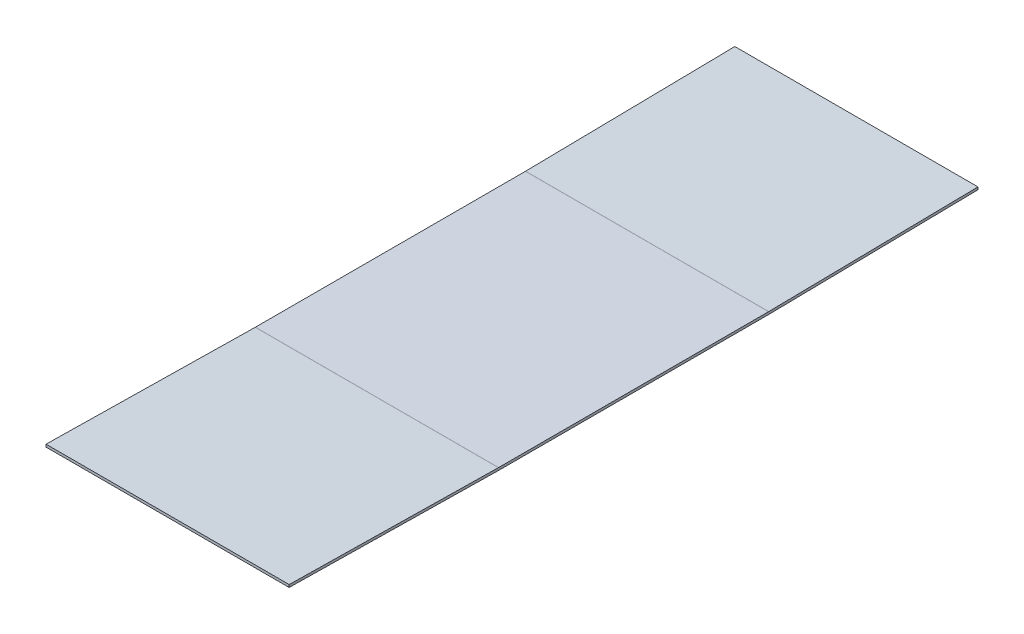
ISO-10303-21;
HEADER;
FILE_DESCRIPTION(('STEP AP214'),'2;1');
FILE_NAME('part.step','',(''),(''),'','','');
FILE_SCHEMA(('AUTOMOTIVE_DESIGN { 1 0 10303 214 1 1 1 1 }'));
ENDSEC;
DATA;
#1=APPLICATION_CONTEXT('core data for automotive mechanical design processes');
#2=APPLICATION_PROTOCOL_DEFINITION('international standard','automotive_design',2000,#1);
#3=PRODUCT_CONTEXT('',#1,'mechanical');
#4=PRODUCT('Part','Part','',(#3));
#5=PRODUCT_RELATED_PRODUCT_CATEGORY('part','',(#4));
#6=PRODUCT_DEFINITION_FORMATION('','',#4);
#7=PRODUCT_DEFINITION_CONTEXT('part definition',#1,'design');
#8=PRODUCT_DEFINITION('design','',#6,#7);
#9=PRODUCT_DEFINITION_SHAPE('','',#8);
#10=(LENGTH_UNIT() NAMED_UNIT(*) SI_UNIT(.MILLI.,.METRE.));
#11=(NAMED_UNIT(*) PLANE_ANGLE_UNIT() SI_UNIT($,.RADIAN.));
#12=(NAMED_UNIT(*) SI_UNIT($,.STERADIAN.) SOLID_ANGLE_UNIT());
#13=UNCERTAINTY_MEASURE_WITH_UNIT(LENGTH_MEASURE(1.E-05),#10,'distance_accuracy_value','');
#14=(GEOMETRIC_REPRESENTATION_CONTEXT(3) GLOBAL_UNCERTAINTY_ASSIGNED_CONTEXT((#13)) GLOBAL_UNIT_ASSIGNED_CONTEXT((#10,
#11,#12)) REPRESENTATION_CONTEXT('',''));
#15=CARTESIAN_POINT('',(0.,0.,0.));
#16=DIRECTION('',(0.,0.,1.));
#17=DIRECTION('',(1.,0.,0.));
#18=AXIS2_PLACEMENT_3D('',#15,#16,#17);
#19=CARTESIAN_POINT('',(-457.2,0.000393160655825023,254.000001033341));
#20=DIRECTION('',(0.,-0.99986986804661,0.0161321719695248));
#21=DIRECTION('',(0.,-0.0161321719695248,-0.99986986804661));
#22=AXIS2_PLACEMENT_3D('',#19,#20,#21);
#23=PLANE('',#22);
#24=DIRECTION('',(0.,-0.0161321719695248,-0.99986986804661));
#25=VECTOR('',#24,1.);
#26=CARTESIAN_POINT('',(-457.2,0.000393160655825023,254.000001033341));
#27=LINE('',#26,#25);
#28=CARTESIAN_POINT('',(-457.2,6.35162926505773,647.648768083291));
#29=VERTEX_POINT('',#28);
#30=CARTESIAN_POINT('',(-457.2,0.00369851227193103,254.204866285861));
#31=VERTEX_POINT('',#30);
#32=EDGE_CURVE('E149',#29,#31,#27,.T.);
#33=ORIENTED_EDGE('',*,*,#32,.T.);
#34=DIRECTION('',(1.,0.,0.));
#35=VECTOR('',#34,1.);
#36=CARTESIAN_POINT('',(-457.2,0.00369851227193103,254.204866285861));
#37=LINE('',#36,#35);
#38=CARTESIAN_POINT('',(0.,0.00369851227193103,254.204866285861));
#39=VERTEX_POINT('',#38);
#40=EDGE_CURVE('E192',#31,#39,#37,.T.);
#41=ORIENTED_EDGE('',*,*,#40,.T.);
#42=DIRECTION('',(0.,-0.0161321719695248,-0.99986986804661));
#43=VECTOR('',#42,1.);
#44=CARTESIAN_POINT('',(0.,0.000393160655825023,254.000001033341));
#45=LINE('',#44,#43);
#46=CARTESIAN_POINT('',(0.,6.35162926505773,647.648768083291));
#47=VERTEX_POINT('',#46);
#48=EDGE_CURVE('E213',#47,#39,#45,.T.);
#49=ORIENTED_EDGE('',*,*,#48,.F.);
#50=DIRECTION('',(1.,0.,0.));
#51=VECTOR('',#50,1.);
#52=CARTESIAN_POINT('',(-457.2,6.35162926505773,647.648768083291));
#53=LINE('',#52,#51);
#54=EDGE_CURVE('E168',#29,#47,#53,.T.);
#55=ORIENTED_EDGE('',*,*,#54,.F.);
#56=EDGE_LOOP('',(#33,#41,#49,#55));
#57=FACE_BOUND('',#56,.T.);
#58=ADVANCED_FACE('F32',(#57),#23,.T.);
#59=CARTESIAN_POINT('',(-457.2,11.1001931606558,647.572153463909));
#60=DIRECTION('',(0.,0.0161321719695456,0.99986986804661));
#61=DIRECTION('',(0.,-0.99986986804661,0.0161321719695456));
#62=AXIS2_PLACEMENT_3D('',#59,#60,#61);
#63=PLANE('',#62);
#64=DIRECTION('',(0.,-0.99986986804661,0.0161321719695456));
#65=VECTOR('',#64,1.);
#66=CARTESIAN_POINT('',(0.,11.1001931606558,647.572153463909));
#67=LINE('',#66,#65);
#68=CARTESIAN_POINT('',(0.,11.1001931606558,647.572153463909));
#69=VERTEX_POINT('',#68);
#70=EDGE_CURVE('E146',#69,#47,#67,.T.);
#71=ORIENTED_EDGE('',*,*,#70,.F.);
#72=DIRECTION('',(1.,0.,0.));
#73=VECTOR('',#72,1.);
#74=CARTESIAN_POINT('',(-457.2,11.1001931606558,647.572153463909));
#75=LINE('',#74,#73);
#76=CARTESIAN_POINT('',(-457.2,11.1001931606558,647.572153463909));
#77=VERTEX_POINT('',#76);
#78=EDGE_CURVE('E171',#77,#69,#75,.T.);
#79=ORIENTED_EDGE('',*,*,#78,.F.);
#80=DIRECTION('',(0.,-0.99986986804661,0.0161321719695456));
#81=VECTOR('',#80,1.);
#82=CARTESIAN_POINT('',(-457.2,11.1001931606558,647.572153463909));
#83=LINE('',#82,#81);
#84=EDGE_CURVE('E132',#77,#29,#83,.T.);
#85=ORIENTED_EDGE('',*,*,#84,.T.);
#86=ORIENTED_EDGE('',*,*,#54,.T.);
#87=EDGE_LOOP('',(#71,#79,#85,#86));
#88=FACE_BOUND('',#87,.T.);
#89=ADVANCED_FACE('F234',(#88),#63,.T.);
#90=CARTESIAN_POINT('',(-457.2,4.75019316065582,254.));
#91=DIRECTION('',(0.,0.99986986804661,-0.0161321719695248));
#92=DIRECTION('',(0.,0.0161321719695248,0.99986986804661));
#93=AXIS2_PLACEMENT_3D('',#90,#91,#92);
#94=PLANE('',#93);
#95=DIRECTION('',(0.,0.0161321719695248,0.99986986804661));
#96=VECTOR('',#95,1.);
#97=CARTESIAN_POINT('',(0.,4.75019316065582,254.));
#98=LINE('',#97,#96);
#99=CARTESIAN_POINT('',(0.,4.75349851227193,254.204865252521));
#100=VERTEX_POINT('',#99);
#101=EDGE_CURVE('E144',#100,#69,#98,.T.);
#102=ORIENTED_EDGE('',*,*,#101,.F.);
#103=DIRECTION('',(1.,0.,0.));
#104=VECTOR('',#103,1.);
#105=CARTESIAN_POINT('',(-457.2,4.75349851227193,254.204865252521));
#106=LINE('',#105,#104);
#107=CARTESIAN_POINT('',(-457.2,4.75349851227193,254.204865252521));
#108=VERTEX_POINT('',#107);
#109=EDGE_CURVE('E179',#100,#108,#106,.F.);
#110=ORIENTED_EDGE('',*,*,#109,.T.);
#111=DIRECTION('',(0.,0.0161321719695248,0.99986986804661));
#112=VECTOR('',#111,1.);
#113=CARTESIAN_POINT('',(-457.2,4.75019316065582,254.));
#114=LINE('',#113,#112);
#115=EDGE_CURVE('E164',#108,#77,#114,.T.);
#116=ORIENTED_EDGE('',*,*,#115,.T.);
#117=ORIENTED_EDGE('',*,*,#78,.T.);
#118=EDGE_LOOP('',(#102,#110,#116,#117));
#119=FACE_BOUND('',#118,.T.);
#120=ADVANCED_FACE('F238',(#119),#94,.T.);
#121=CARTESIAN_POINT('',(-457.2,4.75019316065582,254.));
#122=DIRECTION('',(0.,1.,0.));
#123=DIRECTION('',(0.,0.,1.));
#124=AXIS2_PLACEMENT_3D('',#121,#122,#123);
#125=PLANE('',#124);
#126=DIRECTION('',(0.,0.,1.));
#127=VECTOR('',#126,1.);
#128=CARTESIAN_POINT('',(-457.2,4.75019316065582,254.));
#129=LINE('',#128,#127);
#130=CARTESIAN_POINT('',(-457.2,4.75019316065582,-253.795108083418));
#131=VERTEX_POINT('',#130);
#132=CARTESIAN_POINT('',(-457.2,4.75019316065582,253.795108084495));
#133=VERTEX_POINT('',#132);
#134=EDGE_CURVE('E161',#131,#133,#129,.T.);
#135=ORIENTED_EDGE('',*,*,#134,.T.);
#136=DIRECTION('',(1.,0.,0.));
#137=VECTOR('',#136,1.);
#138=CARTESIAN_POINT('',(0.,4.75019316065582,253.795108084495));
#139=LINE('',#138,#137);
#140=CARTESIAN_POINT('',(0.,4.75019316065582,253.795108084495));
#141=VERTEX_POINT('',#140);
#142=EDGE_CURVE('E176',#133,#141,#139,.T.);
#143=ORIENTED_EDGE('',*,*,#142,.T.);
#144=DIRECTION('',(0.,0.,1.));
#145=VECTOR('',#144,1.);
#146=CARTESIAN_POINT('',(0.,4.75019316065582,254.));
#147=LINE('',#146,#145);
#148=CARTESIAN_POINT('',(0.,4.75019316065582,-253.795108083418));
#149=VERTEX_POINT('',#148);
#150=EDGE_CURVE('E138',#149,#141,#147,.T.);
#151=ORIENTED_EDGE('',*,*,#150,.F.);
#152=DIRECTION('',(1.,0.,0.));
#153=VECTOR('',#152,1.);
#154=CARTESIAN_POINT('',(-457.2,4.75019316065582,-253.795108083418));
#155=LINE('',#154,#153);
#156=EDGE_CURVE('E170',#149,#131,#155,.F.);
#157=ORIENTED_EDGE('',*,*,#156,.T.);
#158=EDGE_LOOP('',(#135,#143,#151,#157));
#159=FACE_BOUND('',#158,.T.);
#160=ADVANCED_FACE('F244',(#159),#125,.T.);
#161=CARTESIAN_POINT('',(-457.2,4.75019316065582,-254.));
#162=DIRECTION('',(0.,0.999869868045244,0.0161321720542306));
#163=DIRECTION('',(0.,-0.0161321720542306,0.999869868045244));
#164=AXIS2_PLACEMENT_3D('',#161,#162,#163);
#165=PLANE('',#164);
#166=DIRECTION('',(0.,-0.0161321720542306,0.999869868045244));
#167=VECTOR('',#166,1.);
#168=CARTESIAN_POINT('',(-457.2,4.75019316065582,-254.));
#169=LINE('',#168,#167);
#170=CARTESIAN_POINT('',(-457.2,11.1001931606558,-647.572151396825));
#171=VERTEX_POINT('',#170);
#172=CARTESIAN_POINT('',(-457.2,4.75349851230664,-254.204865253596));
#173=VERTEX_POINT('',#172);
#174=EDGE_CURVE('E158',#171,#173,#169,.T.);
#175=ORIENTED_EDGE('',*,*,#174,.T.);
#176=DIRECTION('',(1.,0.,0.));
#177=VECTOR('',#176,1.);
#178=CARTESIAN_POINT('',(0.,4.75349851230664,-254.204865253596));
#179=LINE('',#178,#177);
#180=CARTESIAN_POINT('',(0.,4.75349851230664,-254.204865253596));
#181=VERTEX_POINT('',#180);
#182=EDGE_CURVE('E181',#173,#181,#179,.T.);
#183=ORIENTED_EDGE('',*,*,#182,.T.);
#184=DIRECTION('',(0.,-0.0161321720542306,0.999869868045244));
#185=VECTOR('',#184,1.);
#186=CARTESIAN_POINT('',(0.,4.75019316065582,-254.));
#187=LINE('',#186,#185);
#188=CARTESIAN_POINT('',(0.,11.1001931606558,-647.572151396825));
#189=VERTEX_POINT('',#188);
#190=EDGE_CURVE('E136',#189,#181,#187,.T.);
#191=ORIENTED_EDGE('',*,*,#190,.F.);
#192=DIRECTION('',(1.,0.,0.));
#193=VECTOR('',#192,1.);
#194=CARTESIAN_POINT('',(-457.2,11.1001931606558,-647.572151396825));
#195=LINE('',#194,#193);
#196=EDGE_CURVE('E131',#171,#189,#195,.T.);
#197=ORIENTED_EDGE('',*,*,#196,.F.);
#198=EDGE_LOOP('',(#175,#183,#191,#197));
#199=FACE_BOUND('',#198,.T.);
#200=ADVANCED_FACE('F252',(#199),#165,.T.);
#201=CARTESIAN_POINT('',(-457.2,6.35162929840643,-647.648766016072));
#202=DIRECTION('',(0.,0.0161321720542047,-0.999869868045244));
#203=DIRECTION('',(0.,0.999869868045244,0.0161321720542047));
#204=AXIS2_PLACEMENT_3D('',#201,#202,#203);
#205=PLANE('',#204);
#206=DIRECTION('',(0.,0.999869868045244,0.0161321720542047));
#207=VECTOR('',#206,1.);
#208=CARTESIAN_POINT('',(0.,6.35162929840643,-647.648766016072));
#209=LINE('',#208,#207);
#210=CARTESIAN_POINT('',(0.,6.35162929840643,-647.648766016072));
#211=VERTEX_POINT('',#210);
#212=EDGE_CURVE('E121',#211,#189,#209,.T.);
#213=ORIENTED_EDGE('',*,*,#212,.F.);
#214=DIRECTION('',(1.,0.,0.));
#215=VECTOR('',#214,1.);
#216=CARTESIAN_POINT('',(-457.2,6.35162929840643,-647.648766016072));
#217=LINE('',#216,#215);
#218=CARTESIAN_POINT('',(-457.2,6.35162929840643,-647.648766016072));
#219=VERTEX_POINT('',#218);
#220=EDGE_CURVE('E125',#219,#211,#217,.T.);
#221=ORIENTED_EDGE('',*,*,#220,.F.);
#222=DIRECTION('',(0.,0.999869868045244,0.0161321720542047));
#223=VECTOR('',#222,1.);
#224=CARTESIAN_POINT('',(-457.2,6.35162929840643,-647.648766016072));
#225=LINE('',#224,#223);
#226=EDGE_CURVE('E156',#219,#171,#225,.T.);
#227=ORIENTED_EDGE('',*,*,#226,.T.);
#228=ORIENTED_EDGE('',*,*,#196,.T.);
#229=EDGE_LOOP('',(#213,#221,#227,#228));
#230=FACE_BOUND('',#229,.T.);
#231=ADVANCED_FACE('F134',(#230),#205,.T.);
#232=CARTESIAN_POINT('',(-457.2,0.000393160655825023,-253.999998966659));
#233=DIRECTION('',(0.,-0.999869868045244,-0.0161321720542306));
#234=DIRECTION('',(0.,0.0161321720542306,-0.999869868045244));
#235=AXIS2_PLACEMENT_3D('',#232,#233,#234);
#236=PLANE('',#235);
#237=DIRECTION('',(0.,0.0161321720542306,-0.999869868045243));
#238=VECTOR('',#237,1.);
#239=CARTESIAN_POINT('',(0.,0.000393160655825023,-253.999998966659));
#240=LINE('',#239,#238);
#241=CARTESIAN_POINT('',(0.,0.0036985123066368,-254.204864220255));
#242=VERTEX_POINT('',#241);
#243=EDGE_CURVE('E116',#242,#211,#240,.T.);
#244=ORIENTED_EDGE('',*,*,#243,.F.);
#245=DIRECTION('',(1.,0.,0.));
#246=VECTOR('',#245,1.);
#247=CARTESIAN_POINT('',(-457.2,0.0036985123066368,-254.204864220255));
#248=LINE('',#247,#246);
#249=CARTESIAN_POINT('',(-457.2,0.0036985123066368,-254.204864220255));
#250=VERTEX_POINT('',#249);
#251=EDGE_CURVE('E39',#242,#250,#248,.F.);
#252=ORIENTED_EDGE('',*,*,#251,.T.);
#253=DIRECTION('',(0.,0.0161321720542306,-0.999869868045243));
#254=VECTOR('',#253,1.);
#255=CARTESIAN_POINT('',(-457.2,0.000393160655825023,-253.999998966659));
#256=LINE('',#255,#254);
#257=EDGE_CURVE('E127',#250,#219,#256,.T.);
#258=ORIENTED_EDGE('',*,*,#257,.T.);
#259=ORIENTED_EDGE('',*,*,#220,.T.);
#260=EDGE_LOOP('',(#244,#252,#258,#259));
#261=FACE_BOUND('',#260,.T.);
#262=ADVANCED_FACE('F126',(#261),#236,.T.);
#263=CARTESIAN_POINT('',(-457.2,0.000393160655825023,254.000001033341));
#264=DIRECTION('',(0.,-1.,0.));
#265=DIRECTION('',(0.,0.,-1.));
#266=AXIS2_PLACEMENT_3D('',#263,#264,#265);
#267=PLANE('',#266);
#268=DIRECTION('',(0.,0.,-1.));
#269=VECTOR('',#268,1.);
#270=CARTESIAN_POINT('',(-457.2,0.000393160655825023,254.000001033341));
#271=LINE('',#270,#269);
#272=CARTESIAN_POINT('',(-457.2,0.000393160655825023,253.795109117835));
#273=VERTEX_POINT('',#272);
#274=CARTESIAN_POINT('',(-457.2,0.000393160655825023,-253.795107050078));
#275=VERTEX_POINT('',#274);
#276=EDGE_CURVE('E152',#273,#275,#271,.T.);
#277=ORIENTED_EDGE('',*,*,#276,.T.);
#278=DIRECTION('',(1.,0.,0.));
#279=VECTOR('',#278,1.);
#280=CARTESIAN_POINT('',(-457.2,0.000393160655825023,-253.795107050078));
#281=LINE('',#280,#279);
#282=CARTESIAN_POINT('',(0.,0.000393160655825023,-253.795107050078));
#283=VERTEX_POINT('',#282);
#284=EDGE_CURVE('E201',#275,#283,#281,.T.);
#285=ORIENTED_EDGE('',*,*,#284,.T.);
#286=DIRECTION('',(0.,0.,-1.));
#287=VECTOR('',#286,1.);
#288=CARTESIAN_POINT('',(0.,0.000393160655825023,254.000001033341));
#289=LINE('',#288,#287);
#290=CARTESIAN_POINT('',(0.,0.000393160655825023,253.795109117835));
#291=VERTEX_POINT('',#290);
#292=EDGE_CURVE('E122',#291,#283,#289,.T.);
#293=ORIENTED_EDGE('',*,*,#292,.F.);
#294=DIRECTION('',(1.,0.,0.));
#295=VECTOR('',#294,1.);
#296=CARTESIAN_POINT('',(-457.2,0.000393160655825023,253.795109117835));
#297=LINE('',#296,#295);
#298=EDGE_CURVE('E197',#291,#273,#297,.F.);
#299=ORIENTED_EDGE('',*,*,#298,.T.);
#300=EDGE_LOOP('',(#277,#285,#293,#299));
#301=FACE_BOUND('',#300,.T.);
#302=ADVANCED_FACE('F207',(#301),#267,.T.);
#303=CARTESIAN_POINT('',(-457.2,6.35162926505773,647.648768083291));
#304=DIRECTION('',(1.,0.,0.));
#305=DIRECTION('',(0.,0.,-1.));
#306=AXIS2_PLACEMENT_3D('',#303,#304,#305);
#307=PLANE('',#306);
#308=ORIENTED_EDGE('',*,*,#257,.F.);
#309=CARTESIAN_POINT('',(-457.2,25.4003931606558,-253.795107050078));
#310=DIRECTION('',(1.,0.,0.));
#311=DIRECTION('',(0.,0.,-1.));
#312=AXIS2_PLACEMENT_3D('',#309,#310,#311);
#313=CIRCLE('',#312,25.4);
#314=EDGE_CURVE('E11',#250,#275,#313,.F.);
#315=ORIENTED_EDGE('',*,*,#314,.T.);
#316=ORIENTED_EDGE('',*,*,#276,.F.);
#317=CARTESIAN_POINT('',(-457.2,25.4003931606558,253.795109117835));
#318=DIRECTION('',(1.,0.,0.));
#319=DIRECTION('',(0.,0.,-1.));
#320=AXIS2_PLACEMENT_3D('',#317,#318,#319);
#321=CIRCLE('',#320,25.4);
#322=EDGE_CURVE('E199',#273,#31,#321,.F.);
#323=ORIENTED_EDGE('',*,*,#322,.T.);
#324=ORIENTED_EDGE('',*,*,#32,.F.);
#325=ORIENTED_EDGE('',*,*,#84,.F.);
#326=ORIENTED_EDGE('',*,*,#115,.F.);
#327=CARTESIAN_POINT('',(-457.2,30.1501931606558,253.795108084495));
#328=DIRECTION('',(1.,0.,0.));
#329=DIRECTION('',(0.,0.,-1.));
#330=AXIS2_PLACEMENT_3D('',#327,#328,#329);
#331=CIRCLE('',#330,25.4);
#332=EDGE_CURVE('E186',#108,#133,#331,.T.);
#333=ORIENTED_EDGE('',*,*,#332,.T.);
#334=ORIENTED_EDGE('',*,*,#134,.F.);
#335=CARTESIAN_POINT('',(-457.2,30.1501931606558,-253.795108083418));
#336=DIRECTION('',(1.,0.,0.));
#337=DIRECTION('',(0.,0.,-1.));
#338=AXIS2_PLACEMENT_3D('',#335,#336,#337);
#339=CIRCLE('',#338,25.4);
#340=EDGE_CURVE('E190',#131,#173,#339,.T.);
#341=ORIENTED_EDGE('',*,*,#340,.T.);
#342=ORIENTED_EDGE('',*,*,#174,.F.);
#343=ORIENTED_EDGE('',*,*,#226,.F.);
#344=EDGE_LOOP('',(#308,#315,#316,#323,#324,#325,#326,#333,#334,#341,#342,#343));
#345=FACE_BOUND('',#344,.T.);
#346=ADVANCED_FACE('F224',(#345),#307,.F.);
#347=CARTESIAN_POINT('',(0.,6.35162926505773,647.648768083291));
#348=DIRECTION('',(1.,0.,0.));
#349=DIRECTION('',(0.,0.,-1.));
#350=AXIS2_PLACEMENT_3D('',#347,#348,#349);
#351=PLANE('',#350);
#352=ORIENTED_EDGE('',*,*,#292,.T.);
#353=CARTESIAN_POINT('',(0.,25.4003931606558,-253.795107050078));
#354=DIRECTION('',(1.,0.,0.));
#355=DIRECTION('',(0.,0.,-1.));
#356=AXIS2_PLACEMENT_3D('',#353,#354,#355);
#357=CIRCLE('',#356,25.4);
#358=EDGE_CURVE('E53',#283,#242,#357,.T.);
#359=ORIENTED_EDGE('',*,*,#358,.T.);
#360=ORIENTED_EDGE('',*,*,#243,.T.);
#361=ORIENTED_EDGE('',*,*,#212,.T.);
#362=ORIENTED_EDGE('',*,*,#190,.T.);
#363=CARTESIAN_POINT('',(0.,30.1501931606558,-253.795108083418));
#364=DIRECTION('',(1.,0.,0.));
#365=DIRECTION('',(0.,0.,-1.));
#366=AXIS2_PLACEMENT_3D('',#363,#364,#365);
#367=CIRCLE('',#366,25.4);
#368=EDGE_CURVE('E188',#181,#149,#367,.F.);
#369=ORIENTED_EDGE('',*,*,#368,.T.);
#370=ORIENTED_EDGE('',*,*,#150,.T.);
#371=CARTESIAN_POINT('',(0.,30.1501931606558,253.795108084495));
#372=DIRECTION('',(1.,0.,0.));
#373=DIRECTION('',(0.,0.,-1.));
#374=AXIS2_PLACEMENT_3D('',#371,#372,#373);
#375=CIRCLE('',#374,25.4);
#376=EDGE_CURVE('E184',#141,#100,#375,.F.);
#377=ORIENTED_EDGE('',*,*,#376,.T.);
#378=ORIENTED_EDGE('',*,*,#101,.T.);
#379=ORIENTED_EDGE('',*,*,#70,.T.);
#380=ORIENTED_EDGE('',*,*,#48,.T.);
#381=CARTESIAN_POINT('',(0.,25.4003931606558,253.795109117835));
#382=DIRECTION('',(1.,0.,0.));
#383=DIRECTION('',(0.,0.,-1.));
#384=AXIS2_PLACEMENT_3D('',#381,#382,#383);
#385=CIRCLE('',#384,25.4);
#386=EDGE_CURVE('E195',#39,#291,#385,.T.);
#387=ORIENTED_EDGE('',*,*,#386,.T.);
#388=EDGE_LOOP('',(#352,#359,#360,#361,#362,#369,#370,#377,#378,#379,#380,#387));
#389=FACE_BOUND('',#388,.T.);
#390=ADVANCED_FACE('F118',(#389),#351,.T.);
#391=CARTESIAN_POINT('',(-457.2,30.1501931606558,253.795108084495));
#392=DIRECTION('',(-1.,0.,0.));
#393=DIRECTION('',(0.,0.,1.));
#394=AXIS2_PLACEMENT_3D('',#391,#392,#393);
#395=CYLINDRICAL_SURFACE('',#394,25.4);
#396=ORIENTED_EDGE('',*,*,#332,.F.);
#397=ORIENTED_EDGE('',*,*,#109,.F.);
#398=ORIENTED_EDGE('',*,*,#376,.F.);
#399=ORIENTED_EDGE('',*,*,#142,.F.);
#400=EDGE_LOOP('',(#396,#397,#398,#399));
#401=FACE_BOUND('',#400,.T.);
#402=ADVANCED_FACE('F267',(#401),#395,.F.);
#403=CARTESIAN_POINT('',(-457.2,30.1501931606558,-253.795108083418));
#404=DIRECTION('',(-1.,0.,0.));
#405=DIRECTION('',(0.,0.,1.));
#406=AXIS2_PLACEMENT_3D('',#403,#404,#405);
#407=CYLINDRICAL_SURFACE('',#406,25.4);
#408=ORIENTED_EDGE('',*,*,#340,.F.);
#409=ORIENTED_EDGE('',*,*,#156,.F.);
#410=ORIENTED_EDGE('',*,*,#368,.F.);
#411=ORIENTED_EDGE('',*,*,#182,.F.);
#412=EDGE_LOOP('',(#408,#409,#410,#411));
#413=FACE_BOUND('',#412,.T.);
#414=ADVANCED_FACE('F231',(#413),#407,.F.);
#415=CARTESIAN_POINT('',(-457.2,25.4003931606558,253.795109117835));
#416=DIRECTION('',(1.,0.,0.));
#417=DIRECTION('',(0.,0.,-1.));
#418=AXIS2_PLACEMENT_3D('',#415,#416,#417);
#419=CYLINDRICAL_SURFACE('',#418,25.4);
#420=ORIENTED_EDGE('',*,*,#322,.F.);
#421=ORIENTED_EDGE('',*,*,#298,.F.);
#422=ORIENTED_EDGE('',*,*,#386,.F.);
#423=ORIENTED_EDGE('',*,*,#40,.F.);
#424=EDGE_LOOP('',(#420,#421,#422,#423));
#425=FACE_BOUND('',#424,.T.);
#426=ADVANCED_FACE('F222',(#425),#419,.T.);
#427=CARTESIAN_POINT('',(-457.2,25.4003931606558,-253.795107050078));
#428=DIRECTION('',(1.,0.,0.));
#429=DIRECTION('',(0.,0.,-1.));
#430=AXIS2_PLACEMENT_3D('',#427,#428,#429);
#431=CYLINDRICAL_SURFACE('',#430,25.4);
#432=ORIENTED_EDGE('',*,*,#314,.F.);
#433=ORIENTED_EDGE('',*,*,#251,.F.);
#434=ORIENTED_EDGE('',*,*,#358,.F.);
#435=ORIENTED_EDGE('',*,*,#284,.F.);
#436=EDGE_LOOP('',(#432,#433,#434,#435));
#437=FACE_BOUND('',#436,.T.);
#438=ADVANCED_FACE('F225',(#437),#431,.T.);
#439=CLOSED_SHELL('',(#58,#89,#120,#160,#200,#231,#262,#302,#346,#390,#402,#414,#426,#438));
#440=MANIFOLD_SOLID_BREP('B2',#439);
#441=ADVANCED_BREP_SHAPE_REPRESENTATION('',(#18,#440),#14);
#442=SHAPE_DEFINITION_REPRESENTATION(#9,#441);
ENDSEC;
END-ISO-10303-21;
